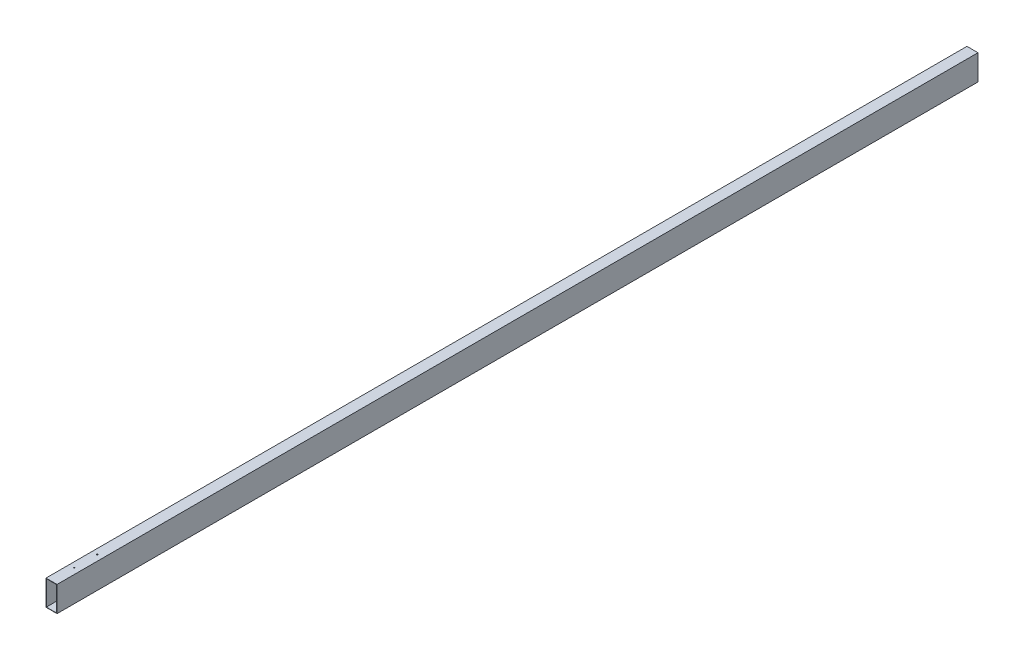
from build123d import *

# Parameters (mm, degrees)
SKETCH2_W           = 48
SKETCH2_H           = 110
SKETCH2_W_2         = 45
SKETCH2_H_2         = 107
BOSS_EXTRUDE1_DEPTH = 4000
LPATTERN1_COUNT     = 2
LPATTERN1_PITCH     = 100
LPATTERN2_COUNT     = 2
LPATTERN2_PITCH     = 100
SKETCH11_R          = 15
CUT_EXTRUDE1_DEPTH  = 10


with BuildPart() as part:
    # Sketch2 → Boss-Extrude1 (new body)
    with BuildSketch(Plane.XY):
        Rectangle(SKETCH2_W, SKETCH2_H)
        Rectangle(SKETCH2_W_2, SKETCH2_H_2, mode=Mode.SUBTRACT)
    extrude(amount=BOSS_EXTRUDE1_DEPTH)

    # Sketch5 → 5.0mm Dowel Slot1 (revolve, cut)
    with BuildSketch(Plane(origin=(-1.5, 55, 3900), x_dir=(0, 0, 1), z_dir=(1, 0, 0))):
        Polygon((0, 0), (0, 11.552151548), (2.5, 10.05), (2.5, 0), align=None)
    f_5_0mm_dowel_slot1 = revolve(axis=Axis((-1.5, 61.35, 3900), (0, -1, 0)), mode=Mode.SUBTRACT)

    # LPattern1: 5.0mm Dowel Slot1 ×2
    with Locations(*[(0, 0, -i * LPATTERN1_PITCH) for i in range(1, LPATTERN1_COUNT)]):
        add(f_5_0mm_dowel_slot1, mode=Mode.SUBTRACT)

    # Sketch7 → 5.0mm Dowel Slot2 (revolve, cut)
    with BuildSketch(Plane(origin=(-1.5, -55, 3900), x_dir=(0, 0, -1), z_dir=(1, 0, 0))):
        Polygon((0, 0), (0, 11.552151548), (2.5, 10.05), (2.5, 0), align=None)
    f_5_0mm_dowel_slot2 = revolve(axis=Axis((-1.5, -61.35, 3900), (0, 1, 0)), mode=Mode.SUBTRACT)

    # LPattern2: 5.0mm Dowel Slot2 ×2
    with Locations(*[(0, 0, -i * LPATTERN2_PITCH) for i in range(1, LPATTERN2_COUNT)]):
        add(f_5_0mm_dowel_slot2, mode=Mode.SUBTRACT)

    # Sketch11 → Cut-Extrude1 (cut)
    with BuildSketch(Plane.ZY.offset(24)):
        with Locations((3850, 5)):
            Circle(SKETCH11_R)
    extrude(amount=-CUT_EXTRUDE1_DEPTH, mode=Mode.SUBTRACT)


solid = part.part
